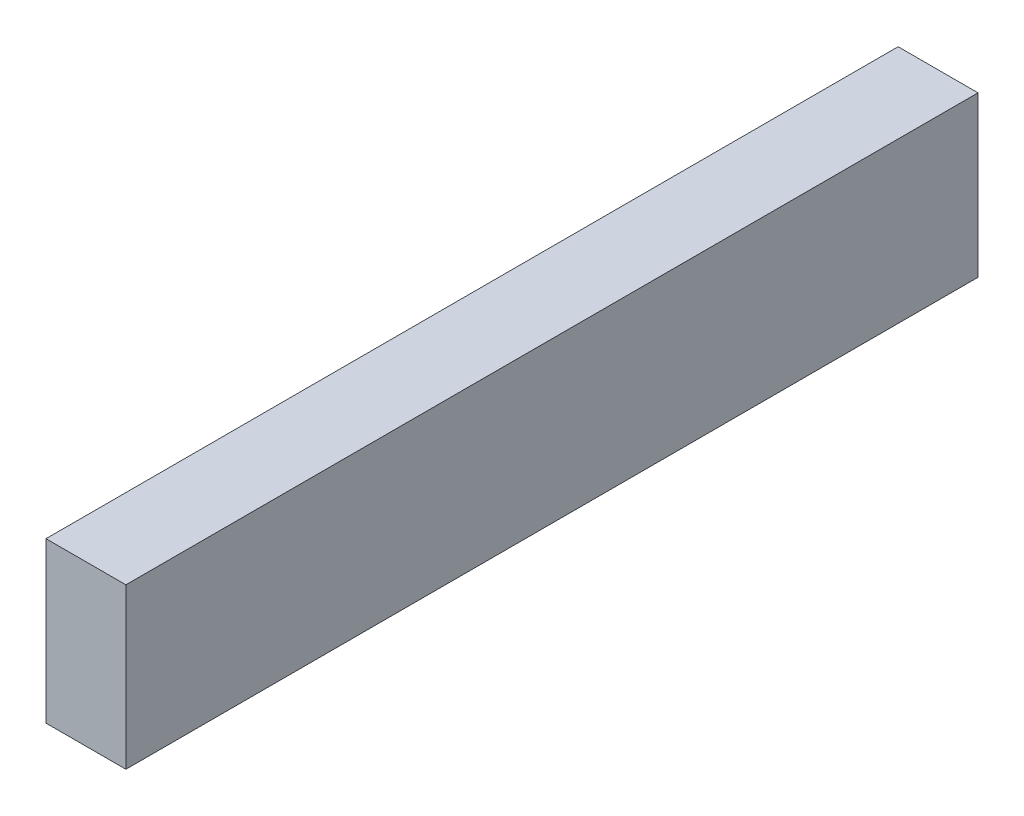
ISO-10303-21;
HEADER;
FILE_DESCRIPTION(('STEP AP214'),'2;1');
FILE_NAME('part.step','',(''),(''),'','','');
FILE_SCHEMA(('AUTOMOTIVE_DESIGN { 1 0 10303 214 1 1 1 1 }'));
ENDSEC;
DATA;
#1=APPLICATION_CONTEXT('core data for automotive mechanical design processes');
#2=APPLICATION_PROTOCOL_DEFINITION('international standard','automotive_design',2000,#1);
#3=PRODUCT_CONTEXT('',#1,'mechanical');
#4=PRODUCT('Part','Part','',(#3));
#5=PRODUCT_RELATED_PRODUCT_CATEGORY('part','',(#4));
#6=PRODUCT_DEFINITION_FORMATION('','',#4);
#7=PRODUCT_DEFINITION_CONTEXT('part definition',#1,'design');
#8=PRODUCT_DEFINITION('design','',#6,#7);
#9=PRODUCT_DEFINITION_SHAPE('','',#8);
#10=(LENGTH_UNIT() NAMED_UNIT(*) SI_UNIT(.MILLI.,.METRE.));
#11=(NAMED_UNIT(*) PLANE_ANGLE_UNIT() SI_UNIT($,.RADIAN.));
#12=(NAMED_UNIT(*) SI_UNIT($,.STERADIAN.) SOLID_ANGLE_UNIT());
#13=UNCERTAINTY_MEASURE_WITH_UNIT(LENGTH_MEASURE(1.E-05),#10,'distance_accuracy_value','');
#14=(GEOMETRIC_REPRESENTATION_CONTEXT(3) GLOBAL_UNCERTAINTY_ASSIGNED_CONTEXT((#13)) GLOBAL_UNIT_ASSIGNED_CONTEXT((#10,
#11,#12)) REPRESENTATION_CONTEXT('',''));
#15=CARTESIAN_POINT('',(0.,0.,0.));
#16=DIRECTION('',(0.,0.,1.));
#17=DIRECTION('',(1.,0.,0.));
#18=AXIS2_PLACEMENT_3D('',#15,#16,#17);
#19=CARTESIAN_POINT('',(0.,0.,160.));
#20=DIRECTION('',(1.,0.,0.));
#21=DIRECTION('',(0.,0.,-1.));
#22=AXIS2_PLACEMENT_3D('',#19,#20,#21);
#23=PLANE('',#22);
#24=DIRECTION('',(0.,-1.,0.));
#25=VECTOR('',#24,1.);
#26=CARTESIAN_POINT('',(0.,0.,0.));
#27=LINE('',#26,#25);
#28=CARTESIAN_POINT('',(0.,30.,0.));
#29=VERTEX_POINT('',#28);
#30=CARTESIAN_POINT('',(0.,0.,0.));
#31=VERTEX_POINT('',#30);
#32=EDGE_CURVE('E74',#29,#31,#27,.T.);
#33=ORIENTED_EDGE('',*,*,#32,.T.);
#34=DIRECTION('',(0.,0.,-1.));
#35=VECTOR('',#34,1.);
#36=CARTESIAN_POINT('',(0.,0.,160.));
#37=LINE('',#36,#35);
#38=CARTESIAN_POINT('',(0.,0.,160.));
#39=VERTEX_POINT('',#38);
#40=EDGE_CURVE('E11',#39,#31,#37,.T.);
#41=ORIENTED_EDGE('',*,*,#40,.F.);
#42=DIRECTION('',(0.,-1.,0.));
#43=VECTOR('',#42,1.);
#44=CARTESIAN_POINT('',(0.,0.,160.));
#45=LINE('',#44,#43);
#46=CARTESIAN_POINT('',(0.,30.,160.));
#47=VERTEX_POINT('',#46);
#48=EDGE_CURVE('E92',#47,#39,#45,.T.);
#49=ORIENTED_EDGE('',*,*,#48,.F.);
#50=DIRECTION('',(0.,0.,-1.));
#51=VECTOR('',#50,1.);
#52=CARTESIAN_POINT('',(0.,30.,160.));
#53=LINE('',#52,#51);
#54=EDGE_CURVE('E86',#47,#29,#53,.T.);
#55=ORIENTED_EDGE('',*,*,#54,.T.);
#56=EDGE_LOOP('',(#33,#41,#49,#55));
#57=FACE_BOUND('',#56,.T.);
#58=ADVANCED_FACE('F30',(#57),#23,.F.);
#59=CARTESIAN_POINT('',(0.,0.,160.));
#60=DIRECTION('',(0.,1.,0.));
#61=DIRECTION('',(0.,0.,1.));
#62=AXIS2_PLACEMENT_3D('',#59,#60,#61);
#63=PLANE('',#62);
#64=DIRECTION('',(1.,0.,0.));
#65=VECTOR('',#64,1.);
#66=CARTESIAN_POINT('',(0.,0.,0.));
#67=LINE('',#66,#65);
#68=CARTESIAN_POINT('',(15.,0.,0.));
#69=VERTEX_POINT('',#68);
#70=EDGE_CURVE('E70',#31,#69,#67,.T.);
#71=ORIENTED_EDGE('',*,*,#70,.T.);
#72=DIRECTION('',(0.,0.,-1.));
#73=VECTOR('',#72,1.);
#74=CARTESIAN_POINT('',(15.,0.,160.));
#75=LINE('',#74,#73);
#76=CARTESIAN_POINT('',(15.,0.,160.));
#77=VERTEX_POINT('',#76);
#78=EDGE_CURVE('E37',#77,#69,#75,.T.);
#79=ORIENTED_EDGE('',*,*,#78,.F.);
#80=DIRECTION('',(1.,0.,0.));
#81=VECTOR('',#80,1.);
#82=CARTESIAN_POINT('',(0.,0.,160.));
#83=LINE('',#82,#81);
#84=EDGE_CURVE('E82',#39,#77,#83,.T.);
#85=ORIENTED_EDGE('',*,*,#84,.F.);
#86=ORIENTED_EDGE('',*,*,#40,.T.);
#87=EDGE_LOOP('',(#71,#79,#85,#86));
#88=FACE_BOUND('',#87,.T.);
#89=ADVANCED_FACE('F81',(#88),#63,.F.);
#90=CARTESIAN_POINT('',(15.,0.,160.));
#91=DIRECTION('',(-1.,0.,0.));
#92=DIRECTION('',(0.,0.,1.));
#93=AXIS2_PLACEMENT_3D('',#90,#91,#92);
#94=PLANE('',#93);
#95=DIRECTION('',(0.,1.,0.));
#96=VECTOR('',#95,1.);
#97=CARTESIAN_POINT('',(15.,0.,0.));
#98=LINE('',#97,#96);
#99=CARTESIAN_POINT('',(15.,30.,0.));
#100=VERTEX_POINT('',#99);
#101=EDGE_CURVE('E75',#69,#100,#98,.T.);
#102=ORIENTED_EDGE('',*,*,#101,.T.);
#103=DIRECTION('',(0.,0.,-1.));
#104=VECTOR('',#103,1.);
#105=CARTESIAN_POINT('',(15.,30.,160.));
#106=LINE('',#105,#104);
#107=CARTESIAN_POINT('',(15.,30.,160.));
#108=VERTEX_POINT('',#107);
#109=EDGE_CURVE('E98',#108,#100,#106,.T.);
#110=ORIENTED_EDGE('',*,*,#109,.F.);
#111=DIRECTION('',(0.,1.,0.));
#112=VECTOR('',#111,1.);
#113=CARTESIAN_POINT('',(15.,0.,160.));
#114=LINE('',#113,#112);
#115=EDGE_CURVE('E49',#77,#108,#114,.T.);
#116=ORIENTED_EDGE('',*,*,#115,.F.);
#117=ORIENTED_EDGE('',*,*,#78,.T.);
#118=EDGE_LOOP('',(#102,#110,#116,#117));
#119=FACE_BOUND('',#118,.T.);
#120=ADVANCED_FACE('F101',(#119),#94,.F.);
#121=CARTESIAN_POINT('',(0.,30.,160.));
#122=DIRECTION('',(0.,-1.,0.));
#123=DIRECTION('',(0.,0.,-1.));
#124=AXIS2_PLACEMENT_3D('',#121,#122,#123);
#125=PLANE('',#124);
#126=DIRECTION('',(-1.,0.,0.));
#127=VECTOR('',#126,1.);
#128=CARTESIAN_POINT('',(0.,30.,0.));
#129=LINE('',#128,#127);
#130=EDGE_CURVE('E90',#100,#29,#129,.T.);
#131=ORIENTED_EDGE('',*,*,#130,.T.);
#132=ORIENTED_EDGE('',*,*,#54,.F.);
#133=DIRECTION('',(-1.,0.,0.));
#134=VECTOR('',#133,1.);
#135=CARTESIAN_POINT('',(0.,30.,160.));
#136=LINE('',#135,#134);
#137=EDGE_CURVE('E44',#108,#47,#136,.T.);
#138=ORIENTED_EDGE('',*,*,#137,.F.);
#139=ORIENTED_EDGE('',*,*,#109,.T.);
#140=EDGE_LOOP('',(#131,#132,#138,#139));
#141=FACE_BOUND('',#140,.T.);
#142=ADVANCED_FACE('F103',(#141),#125,.F.);
#143=CARTESIAN_POINT('',(0.,30.,160.));
#144=DIRECTION('',(0.,0.,-1.));
#145=DIRECTION('',(-1.,0.,0.));
#146=AXIS2_PLACEMENT_3D('',#143,#144,#145);
#147=PLANE('',#146);
#148=ORIENTED_EDGE('',*,*,#48,.T.);
#149=ORIENTED_EDGE('',*,*,#84,.T.);
#150=ORIENTED_EDGE('',*,*,#115,.T.);
#151=ORIENTED_EDGE('',*,*,#137,.T.);
#152=EDGE_LOOP('',(#148,#149,#150,#151));
#153=FACE_BOUND('',#152,.T.);
#154=ADVANCED_FACE('F104',(#153),#147,.F.);
#155=CARTESIAN_POINT('',(0.,30.,0.));
#156=DIRECTION('',(0.,0.,-1.));
#157=DIRECTION('',(-1.,0.,0.));
#158=AXIS2_PLACEMENT_3D('',#155,#156,#157);
#159=PLANE('',#158);
#160=ORIENTED_EDGE('',*,*,#32,.F.);
#161=ORIENTED_EDGE('',*,*,#130,.F.);
#162=ORIENTED_EDGE('',*,*,#101,.F.);
#163=ORIENTED_EDGE('',*,*,#70,.F.);
#164=EDGE_LOOP('',(#160,#161,#162,#163));
#165=FACE_BOUND('',#164,.T.);
#166=ADVANCED_FACE('F71',(#165),#159,.T.);
#167=CLOSED_SHELL('',(#58,#89,#120,#142,#154,#166));
#168=MANIFOLD_SOLID_BREP('B2',#167);
#169=ADVANCED_BREP_SHAPE_REPRESENTATION('',(#18,#168),#14);
#170=SHAPE_DEFINITION_REPRESENTATION(#9,#169);
ENDSEC;
END-ISO-10303-21;
